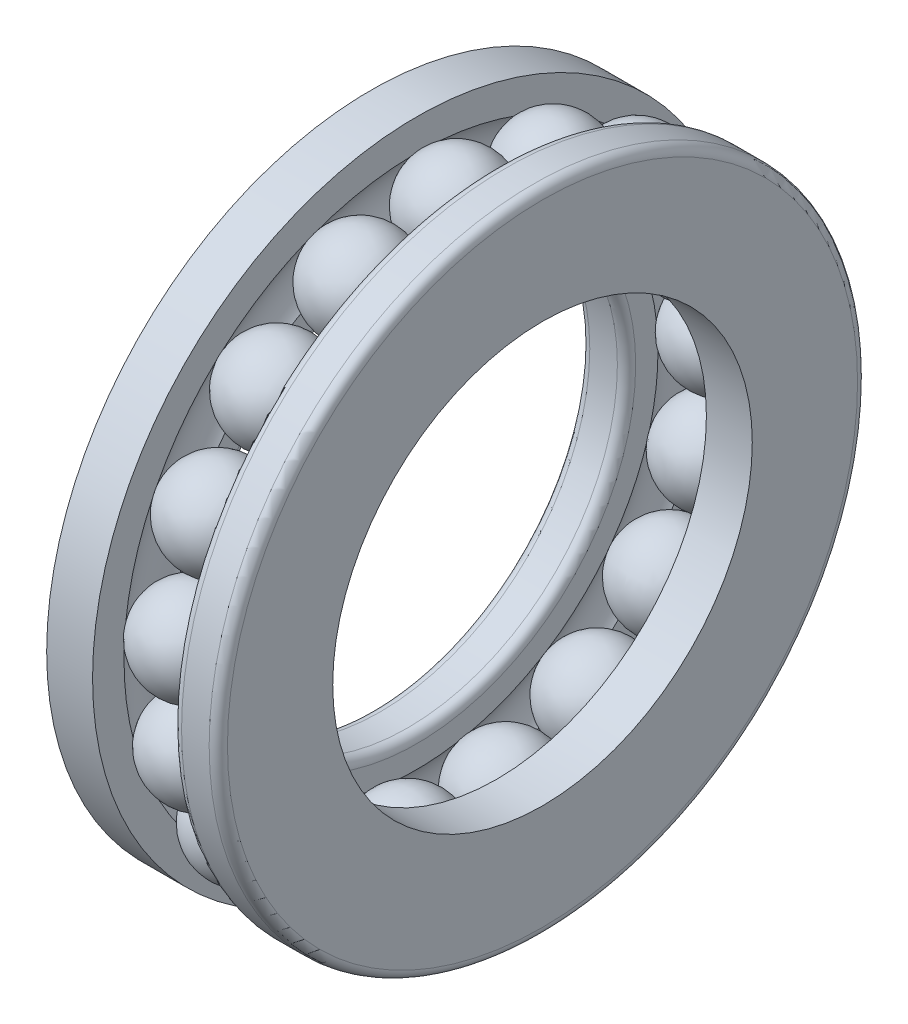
from build123d import *

# Parameters (mm, degrees)
FILLET_2_R          = 1.524
BALLSDETAILED_COUNT = 17
BALLSDETAILED_ANGLE = 338.823529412


with BuildPart() as part:
    # InnRacSke → Race (revolve)
    with BuildSketch(Plane.XY, mode=Mode.PRIVATE) as race_sk:
        with BuildLine():
            Line((-6.6468625, 40.158083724), (-6.6468625, 34.925))
            Line((-6.6468625, 34.925), (-14.2875, 34.925))
            Line((-14.2875, 34.925), (-14.2875, 53.975))
            Line((-14.2875, 53.975), (-6.6468625, 53.975))
            Line((-6.6468625, 53.975), (-6.6468625, 48.741916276))
            ThreePointArc((-6.6468625, 48.741916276), (-7.9121, 44.45), (-6.6468625, 40.158083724))
        make_face()
    race = revolve(race_sk.sketch.rotate(Axis((-34.921943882, 0, 0), (1, 0, 0)), 270), axis=Axis((-34.921943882, 0, 0), (1, 0, 0)))

    # BalDetSke → BallDetailed (revolve)
    with BuildSketch(Plane.XY):
        with BuildLine():
            Line((-7.9375, 44.45), (7.9375, 44.45))
            ThreePointArc((7.9375, 44.45), (0, 36.5125), (-7.9375, 44.45))
        make_face()
    balldetailed = revolve(axis=Axis((-14.57325, 44.45, 0), (1, 0, 0)))

    # Mirror1: Race across plane
    add(race.mirror(Plane(origin=(0, 0, 0), x_dir=(0, 0, 1), z_dir=(1, 0, 0))))

    # Fillet 2
    fillet_2_edges = [part.edges().sort_by_distance(p)[0] for p in [
        (6.6468625, 0, 53.975),
        (14.2875, 0, 53.975),
        (-6.6468625, 0, 34.925),
        (-14.2875, 0, 34.925),
    ]]
    fillet(fillet_2_edges, radius=FILLET_2_R)

    # BallsDetailed: BallDetailed ×17 about axis
    ballsdetailed_axis = Axis((-50, 0, 0), (1, 0, 0))
    for i in range(1, BALLSDETAILED_COUNT):
        add(balldetailed.rotate(ballsdetailed_axis, i * BALLSDETAILED_ANGLE / (BALLSDETAILED_COUNT - 1)))


solid = part.part
